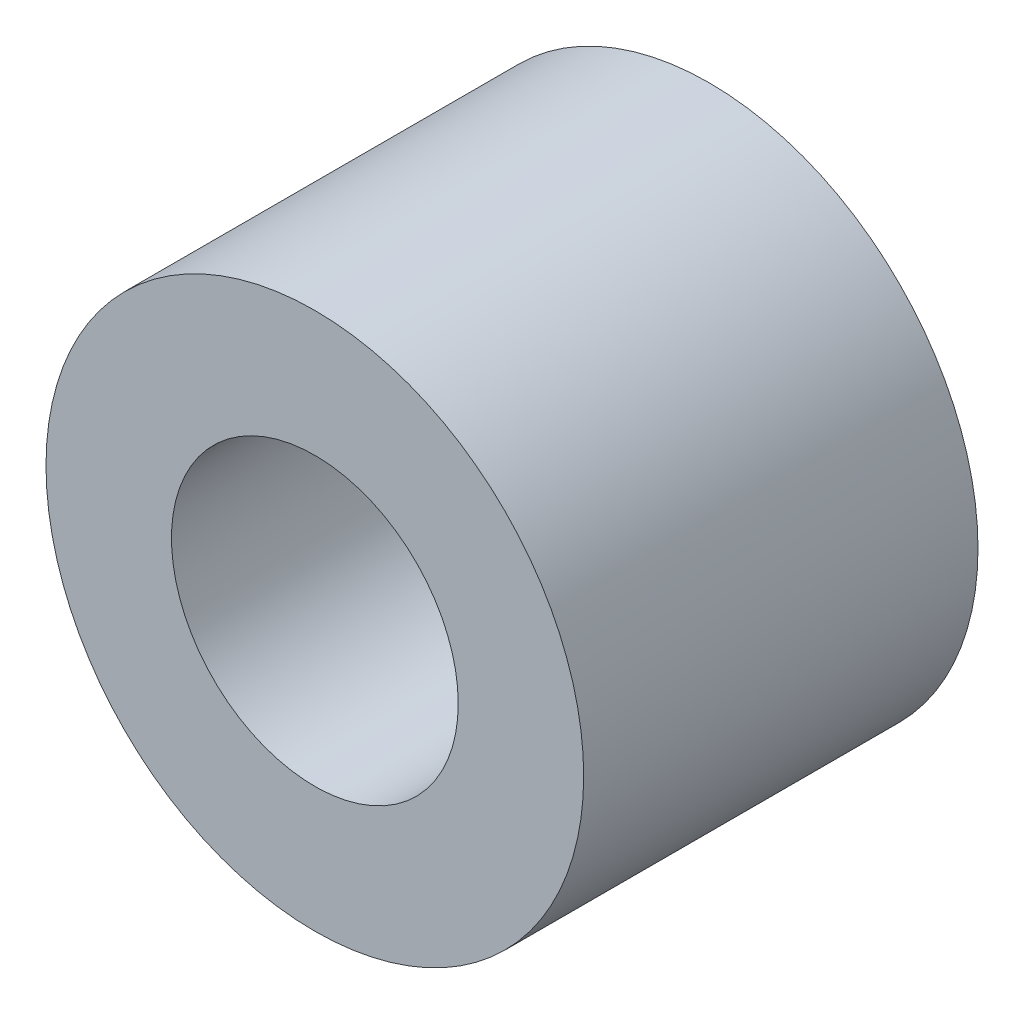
ISO-10303-21;
HEADER;
FILE_DESCRIPTION(('STEP AP214'),'2;1');
FILE_NAME('part.step','',(''),(''),'','','');
FILE_SCHEMA(('AUTOMOTIVE_DESIGN { 1 0 10303 214 1 1 1 1 }'));
ENDSEC;
DATA;
#1=APPLICATION_CONTEXT('core data for automotive mechanical design processes');
#2=APPLICATION_PROTOCOL_DEFINITION('international standard','automotive_design',2000,#1);
#3=PRODUCT_CONTEXT('',#1,'mechanical');
#4=PRODUCT('Part','Part','',(#3));
#5=PRODUCT_RELATED_PRODUCT_CATEGORY('part','',(#4));
#6=PRODUCT_DEFINITION_FORMATION('','',#4);
#7=PRODUCT_DEFINITION_CONTEXT('part definition',#1,'design');
#8=PRODUCT_DEFINITION('design','',#6,#7);
#9=PRODUCT_DEFINITION_SHAPE('','',#8);
#10=(LENGTH_UNIT() NAMED_UNIT(*) SI_UNIT(.MILLI.,.METRE.));
#11=(NAMED_UNIT(*) PLANE_ANGLE_UNIT() SI_UNIT($,.RADIAN.));
#12=(NAMED_UNIT(*) SI_UNIT($,.STERADIAN.) SOLID_ANGLE_UNIT());
#13=UNCERTAINTY_MEASURE_WITH_UNIT(LENGTH_MEASURE(1.E-05),#10,'distance_accuracy_value','');
#14=(GEOMETRIC_REPRESENTATION_CONTEXT(3) GLOBAL_UNCERTAINTY_ASSIGNED_CONTEXT((#13)) GLOBAL_UNIT_ASSIGNED_CONTEXT((#10,
#11,#12)) REPRESENTATION_CONTEXT('',''));
#15=CARTESIAN_POINT('',(0.,0.,0.));
#16=DIRECTION('',(0.,0.,1.));
#17=DIRECTION('',(1.,0.,0.));
#18=AXIS2_PLACEMENT_3D('',#15,#16,#17);
#19=CARTESIAN_POINT('',(0.,0.,11.));
#20=DIRECTION('',(0.,0.,1.));
#21=DIRECTION('',(1.,0.,0.));
#22=AXIS2_PLACEMENT_3D('',#19,#20,#21);
#23=PLANE('',#22);
#24=CARTESIAN_POINT('',(0.,0.,11.));
#25=DIRECTION('',(0.,0.,1.));
#26=DIRECTION('',(1.,0.,0.));
#27=AXIS2_PLACEMENT_3D('',#24,#25,#26);
#28=CIRCLE('',#27,7.5);
#29=CARTESIAN_POINT('',(7.5,0.,11.));
#30=VERTEX_POINT('',#29);
#31=EDGE_CURVE('E8',#30,#30,#28,.T.);
#32=ORIENTED_EDGE('',*,*,#31,.T.);
#33=EDGE_LOOP('',(#32));
#34=FACE_BOUND('',#33,.T.);
#35=CARTESIAN_POINT('',(0.,0.,11.));
#36=DIRECTION('',(0.,0.,1.));
#37=DIRECTION('',(1.,0.,0.));
#38=AXIS2_PLACEMENT_3D('',#35,#36,#37);
#39=CIRCLE('',#38,4.);
#40=CARTESIAN_POINT('',(4.,0.,11.));
#41=VERTEX_POINT('',#40);
#42=EDGE_CURVE('E23',#41,#41,#39,.T.);
#43=ORIENTED_EDGE('',*,*,#42,.F.);
#44=EDGE_LOOP('',(#43));
#45=FACE_BOUND('',#44,.T.);
#46=ADVANCED_FACE('F12',(#34,#45),#23,.T.);
#47=CARTESIAN_POINT('',(0.,0.,0.));
#48=DIRECTION('',(0.,0.,1.));
#49=DIRECTION('',(1.,0.,0.));
#50=AXIS2_PLACEMENT_3D('',#47,#48,#49);
#51=PLANE('',#50);
#52=CARTESIAN_POINT('',(0.,0.,0.));
#53=DIRECTION('',(0.,0.,1.));
#54=DIRECTION('',(1.,0.,0.));
#55=AXIS2_PLACEMENT_3D('',#52,#53,#54);
#56=CIRCLE('',#55,7.5);
#57=CARTESIAN_POINT('',(7.5,0.,0.));
#58=VERTEX_POINT('',#57);
#59=EDGE_CURVE('E16',#58,#58,#56,.T.);
#60=ORIENTED_EDGE('',*,*,#59,.F.);
#61=EDGE_LOOP('',(#60));
#62=FACE_BOUND('',#61,.T.);
#63=CARTESIAN_POINT('',(0.,0.,0.));
#64=DIRECTION('',(0.,0.,1.));
#65=DIRECTION('',(1.,0.,0.));
#66=AXIS2_PLACEMENT_3D('',#63,#64,#65);
#67=CIRCLE('',#66,4.);
#68=CARTESIAN_POINT('',(4.,0.,0.));
#69=VERTEX_POINT('',#68);
#70=EDGE_CURVE('E25',#69,#69,#67,.T.);
#71=ORIENTED_EDGE('',*,*,#70,.T.);
#72=EDGE_LOOP('',(#71));
#73=FACE_BOUND('',#72,.T.);
#74=ADVANCED_FACE('F35',(#62,#73),#51,.F.);
#75=CARTESIAN_POINT('',(0.,0.,11.));
#76=DIRECTION('',(0.,0.,-1.));
#77=DIRECTION('',(-1.,0.,0.));
#78=AXIS2_PLACEMENT_3D('',#75,#76,#77);
#79=CYLINDRICAL_SURFACE('',#78,7.5);
#80=ORIENTED_EDGE('',*,*,#31,.F.);
#81=EDGE_LOOP('',(#80));
#82=FACE_BOUND('',#81,.T.);
#83=ORIENTED_EDGE('',*,*,#59,.T.);
#84=EDGE_LOOP('',(#83));
#85=FACE_BOUND('',#84,.T.);
#86=ADVANCED_FACE('F14',(#82,#85),#79,.T.);
#87=CARTESIAN_POINT('',(0.,0.,11.));
#88=DIRECTION('',(0.,0.,-1.));
#89=DIRECTION('',(-1.,0.,0.));
#90=AXIS2_PLACEMENT_3D('',#87,#88,#89);
#91=CYLINDRICAL_SURFACE('',#90,4.);
#92=ORIENTED_EDGE('',*,*,#42,.T.);
#93=EDGE_LOOP('',(#92));
#94=FACE_BOUND('',#93,.T.);
#95=ORIENTED_EDGE('',*,*,#70,.F.);
#96=EDGE_LOOP('',(#95));
#97=FACE_BOUND('',#96,.T.);
#98=ADVANCED_FACE('F31',(#94,#97),#91,.F.);
#99=CLOSED_SHELL('',(#46,#74,#86,#98));
#100=MANIFOLD_SOLID_BREP('B1',#99);
#101=ADVANCED_BREP_SHAPE_REPRESENTATION('',(#18,#100),#14);
#102=SHAPE_DEFINITION_REPRESENTATION(#9,#101);
ENDSEC;
END-ISO-10303-21;
